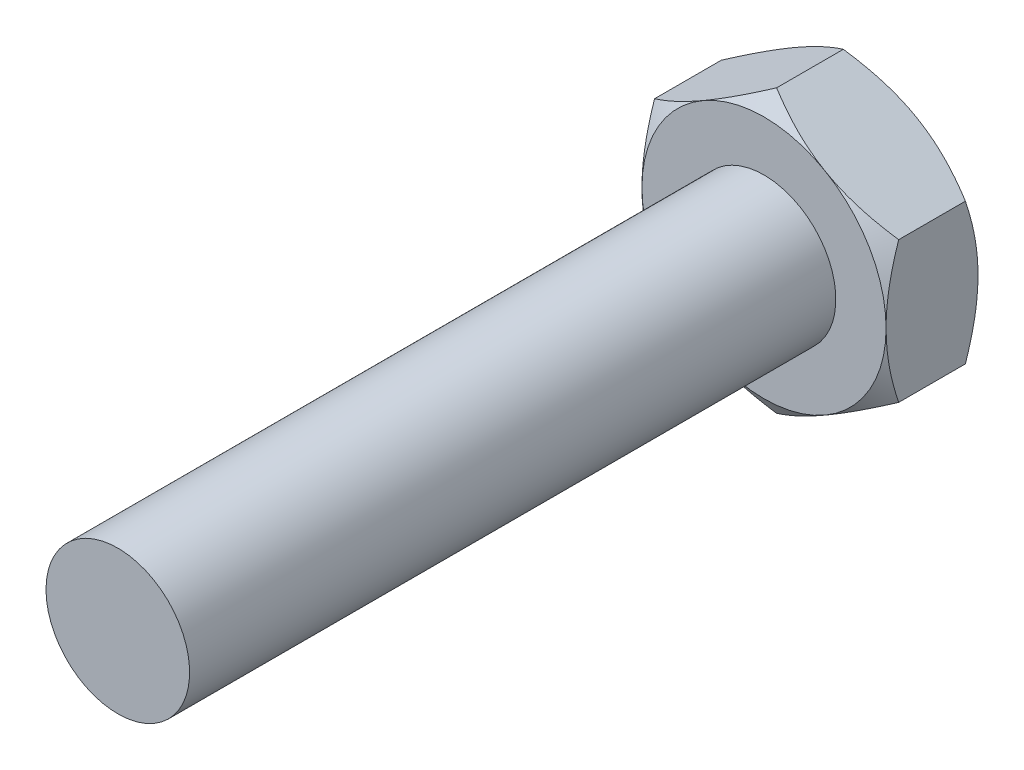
ISO-10303-21;
HEADER;
FILE_DESCRIPTION(('STEP AP214'),'2;1');
FILE_NAME('part.step','',(''),(''),'','','');
FILE_SCHEMA(('AUTOMOTIVE_DESIGN { 1 0 10303 214 1 1 1 1 }'));
ENDSEC;
DATA;
#1=APPLICATION_CONTEXT('core data for automotive mechanical design processes');
#2=APPLICATION_PROTOCOL_DEFINITION('international standard','automotive_design',2000,#1);
#3=PRODUCT_CONTEXT('',#1,'mechanical');
#4=PRODUCT('Part','Part','',(#3));
#5=PRODUCT_RELATED_PRODUCT_CATEGORY('part','',(#4));
#6=PRODUCT_DEFINITION_FORMATION('','',#4);
#7=PRODUCT_DEFINITION_CONTEXT('part definition',#1,'design');
#8=PRODUCT_DEFINITION('design','',#6,#7);
#9=PRODUCT_DEFINITION_SHAPE('','',#8);
#10=(LENGTH_UNIT() NAMED_UNIT(*) SI_UNIT(.MILLI.,.METRE.));
#11=(NAMED_UNIT(*) PLANE_ANGLE_UNIT() SI_UNIT($,.RADIAN.));
#12=(NAMED_UNIT(*) SI_UNIT($,.STERADIAN.) SOLID_ANGLE_UNIT());
#13=UNCERTAINTY_MEASURE_WITH_UNIT(LENGTH_MEASURE(1.E-05),#10,'distance_accuracy_value','');
#14=(GEOMETRIC_REPRESENTATION_CONTEXT(3) GLOBAL_UNCERTAINTY_ASSIGNED_CONTEXT((#13)) GLOBAL_UNIT_ASSIGNED_CONTEXT((#10,
#11,#12)) REPRESENTATION_CONTEXT('',''));
#15=CARTESIAN_POINT('',(0.,0.,0.));
#16=DIRECTION('',(0.,0.,1.));
#17=DIRECTION('',(1.,0.,0.));
#18=AXIS2_PLACEMENT_3D('',#15,#16,#17);
#19=CARTESIAN_POINT('',(8.5,-4.90747728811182,6.4));
#20=DIRECTION('',(-1.,0.,0.));
#21=DIRECTION('',(0.,-1.,0.));
#22=AXIS2_PLACEMENT_3D('',#19,#20,#21);
#23=PLANE('',#22);
#24=DIRECTION('',(0.,0.,-1.));
#25=VECTOR('',#24,1.);
#26=CARTESIAN_POINT('',(8.5,4.90747728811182,6.4));
#27=LINE('',#26,#25);
#28=CARTESIAN_POINT('',(8.5,4.90747728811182,5.52336361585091));
#29=VERTEX_POINT('',#28);
#30=CARTESIAN_POINT('',(8.5,4.90747728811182,0.876636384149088));
#31=VERTEX_POINT('',#30);
#32=EDGE_CURVE('E151',#29,#31,#27,.T.);
#33=ORIENTED_EDGE('',*,*,#32,.F.);
#34=CARTESIAN_POINT('',(8.5,-12.6656336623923,1.89768821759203));
#35=CARTESIAN_POINT('',(8.5,-12.319403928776,2.08929758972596));
#36=CARTESIAN_POINT('',(8.5,-11.9721686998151,2.2791205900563));
#37=CARTESIAN_POINT('',(8.5,-11.2751753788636,2.6542242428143));
#38=CARTESIAN_POINT('',(8.5,-10.9254168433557,2.83950407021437));
#39=CARTESIAN_POINT('',(8.5,-10.2208088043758,3.20561506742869));
#40=CARTESIAN_POINT('',(8.5,-9.86594117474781,3.38641147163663));
#41=CARTESIAN_POINT('',(8.5,-9.15270039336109,3.74092648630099));
#42=CARTESIAN_POINT('',(8.5,-8.79432743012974,3.91464547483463));
#43=CARTESIAN_POINT('',(8.5,-8.05883660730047,4.26000470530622));
#44=CARTESIAN_POINT('',(8.5,-7.68154571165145,4.43127847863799));
#45=CARTESIAN_POINT('',(8.5,-6.92149272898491,4.76145049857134));
#46=CARTESIAN_POINT('',(8.5,-6.53872993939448,4.92034713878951));
#47=CARTESIAN_POINT('',(8.5,-5.76773338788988,5.22173433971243));
#48=CARTESIAN_POINT('',(8.5,-5.3795140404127,5.36426137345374));
#49=CARTESIAN_POINT('',(8.5,-4.59615946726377,5.62856525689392));
#50=CARTESIAN_POINT('',(8.5,-4.2010267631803,5.75034950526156));
#51=CARTESIAN_POINT('',(8.5,-3.38121064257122,5.97349001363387));
#52=CARTESIAN_POINT('',(8.5,-2.95610376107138,6.07333860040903));
#53=CARTESIAN_POINT('',(8.5,-2.31325326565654,6.19549883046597));
#54=CARTESIAN_POINT('',(8.5,-2.09809788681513,6.23161750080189));
#55=CARTESIAN_POINT('',(8.5,-1.66635562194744,6.2938428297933));
#56=CARTESIAN_POINT('',(8.5,-1.44976894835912,6.31995094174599));
#57=CARTESIAN_POINT('',(8.5,-1.01914984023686,6.36115218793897));
#58=CARTESIAN_POINT('',(8.5,-0.805134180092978,6.37641985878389));
#59=CARTESIAN_POINT('',(8.5,-0.376605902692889,6.39623059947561));
#60=CARTESIAN_POINT('',(8.5,-0.162093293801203,6.40077384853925));
#61=CARTESIAN_POINT('',(8.5,0.26690788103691,6.3990107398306));
#62=CARTESIAN_POINT('',(8.5,0.481396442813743,6.39270335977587));
#63=CARTESIAN_POINT('',(8.5,0.909791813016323,6.36941085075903));
#64=CARTESIAN_POINT('',(8.5,1.12369860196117,6.35242536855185));
#65=CARTESIAN_POINT('',(8.5,1.58753059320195,6.30437286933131));
#66=CARTESIAN_POINT('',(8.5,1.83725645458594,6.27137198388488));
#67=CARTESIAN_POINT('',(8.5,2.33461795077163,6.19235151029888));
#68=CARTESIAN_POINT('',(8.5,2.5822534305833,6.14633096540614));
#69=CARTESIAN_POINT('',(8.5,3.32164787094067,5.99068136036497));
#70=CARTESIAN_POINT('',(8.5,3.80976459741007,5.86347907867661));
#71=CARTESIAN_POINT('',(8.5,4.53943756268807,5.64421539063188));
#72=CARTESIAN_POINT('',(8.5,4.78514623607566,5.56526942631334));
#73=CARTESIAN_POINT('',(8.5,5.27386228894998,5.39935263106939));
#74=CARTESIAN_POINT('',(8.5,5.51686965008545,5.31238174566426));
#75=CARTESIAN_POINT('',(8.5,6.00025315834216,5.13163510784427));
#76=CARTESIAN_POINT('',(8.5,6.24062992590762,5.03786100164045));
#77=CARTESIAN_POINT('',(8.5,6.71902382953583,4.84450549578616));
#78=CARTESIAN_POINT('',(8.5,6.95704100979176,4.74492420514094));
#79=CARTESIAN_POINT('',(8.5,7.57277253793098,4.47974433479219));
#80=CARTESIAN_POINT('',(8.5,7.94883245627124,4.3103064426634));
#81=CARTESIAN_POINT('',(8.5,8.69639823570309,3.96163134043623));
#82=CARTESIAN_POINT('',(8.5,9.06790358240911,3.78239303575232));
#83=CARTESIAN_POINT('',(8.5,9.80724128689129,3.41614910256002));
#84=CARTESIAN_POINT('',(8.5,10.1750720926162,3.22914035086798));
#85=CARTESIAN_POINT('',(8.5,10.907535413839,2.849014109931));
#86=CARTESIAN_POINT('',(8.5,11.2721680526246,2.65589685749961));
#87=CARTESIAN_POINT('',(8.5,11.9994706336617,2.26437185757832));
#88=CARTESIAN_POINT('',(8.5,12.3621355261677,2.06595474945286));
#89=CARTESIAN_POINT('',(8.5,13.0852384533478,1.6651037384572));
#90=CARTESIAN_POINT('',(8.5,13.4456764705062,1.46266980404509));
#91=CARTESIAN_POINT('',(8.5,14.1645936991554,1.05454794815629));
#92=CARTESIAN_POINT('',(8.5,14.5230733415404,0.848860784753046));
#93=CARTESIAN_POINT('',(8.5,15.2384446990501,0.434741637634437));
#94=CARTESIAN_POINT('',(8.5,15.5953364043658,0.226309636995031));
#95=CARTESIAN_POINT('',(8.5,16.5902267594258,-0.359025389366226));
#96=CARTESIAN_POINT('',(8.5,17.2267327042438,-0.738465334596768));
#97=CARTESIAN_POINT('',(8.5,18.4964831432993,-1.5028368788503));
#98=CARTESIAN_POINT('',(8.49999999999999,19.12972743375,-1.88776881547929));
#99=CARTESIAN_POINT('',(8.49999999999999,20.3910331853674,-2.66021595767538));
#100=CARTESIAN_POINT('',(8.49999999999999,21.0191052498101,-3.04771386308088));
#101=CARTESIAN_POINT('',(8.49999999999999,21.959673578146,-3.63137569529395));
#102=CARTESIAN_POINT('',(8.49999999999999,22.272925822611,-3.82632340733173));
#103=CARTESIAN_POINT('',(8.49999999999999,22.898976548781,-4.21694458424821));
#104=CARTESIAN_POINT('',(8.49999999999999,23.2117750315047,-4.41261804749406));
#105=CARTESIAN_POINT('',(8.49999999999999,23.5243723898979,-4.60861239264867));
#106=B_SPLINE_CURVE_WITH_KNOTS('',3,(#34,#35,#36,#37,#38,#39,#40,#41,#42,#43,#44,#45,#46,#47,
#48,#49,#50,#51,#52,#53,#54,#55,#56,#57,#58,#59,#60,#61,#62,#63,#64,#65,#66,#67,#68,#69,#70,#71,
#72,#73,#74,#75,#76,#77,#78,#79,#80,#81,#82,#83,#84,#85,#86,#87,#88,#89,#90,#91,#92,#93,#94,#95,
#96,#97,#98,#99,#100,#101,#102,#103,#104,#105),.UNSPECIFIED.,.F.,.F.,(4,2,2,2,2,2,2,2,2,2,2,2,2,
2,2,2,2,2,2,2,2,2,2,2,2,2,2,2,2,2,2,2,2,2,2,4),(0.,1.18715725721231,2.37452852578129,
3.56927236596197,4.76395229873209,6.0068194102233,7.2498475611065,8.49005007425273,
9.72980929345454,11.0383310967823,11.6926331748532,12.3468402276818,12.9902594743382,
13.6336679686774,14.2771370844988,14.9206274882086,15.675922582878,16.431273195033,
17.9423659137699,18.7165255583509,19.4906904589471,20.2646686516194,21.0386323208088,
22.2758393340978,23.5131848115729,24.7510325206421,25.988832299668,27.22898548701,
28.4691484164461,29.7090264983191,30.9489122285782,33.171938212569,35.3951014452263,
37.6090577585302,38.7159374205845,39.8228145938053),.UNSPECIFIED.);
#107=CARTESIAN_POINT('',(8.50000000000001,0.,6.4));
#108=VERTEX_POINT('',#107);
#109=EDGE_CURVE('E133',#29,#108,#106,.F.);
#110=ORIENTED_EDGE('',*,*,#109,.T.);
#111=CARTESIAN_POINT('',(8.5,-4.90747728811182,5.52336361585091));
#112=VERTEX_POINT('',#111);
#113=EDGE_CURVE('E123',#108,#112,#106,.F.);
#114=ORIENTED_EDGE('',*,*,#113,.T.);
#115=DIRECTION('',(0.,0.,-1.));
#116=VECTOR('',#115,1.);
#117=CARTESIAN_POINT('',(8.5,-4.90747728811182,6.4));
#118=LINE('',#117,#116);
#119=CARTESIAN_POINT('',(8.5,-4.90747728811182,0.876636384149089));
#120=VERTEX_POINT('',#119);
#121=EDGE_CURVE('E241',#112,#120,#118,.T.);
#122=ORIENTED_EDGE('',*,*,#121,.T.);
#123=CARTESIAN_POINT('',(8.5,-12.6656336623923,4.50231178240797));
#124=CARTESIAN_POINT('',(8.5,-12.319403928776,4.31070241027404));
#125=CARTESIAN_POINT('',(8.5,-11.9721686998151,4.12087940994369));
#126=CARTESIAN_POINT('',(8.5,-11.2751753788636,3.7457757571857));
#127=CARTESIAN_POINT('',(8.5,-10.9254168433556,3.56049592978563));
#128=CARTESIAN_POINT('',(8.5,-10.2208088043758,3.19438493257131));
#129=CARTESIAN_POINT('',(8.5,-9.86594117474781,3.01358852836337));
#130=CARTESIAN_POINT('',(8.5,-9.15270039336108,2.65907351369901));
#131=CARTESIAN_POINT('',(8.5,-8.79432743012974,2.48535452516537));
#132=CARTESIAN_POINT('',(8.5,-8.05883660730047,2.13999529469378));
#133=CARTESIAN_POINT('',(8.5,-7.68154571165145,1.96872152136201));
#134=CARTESIAN_POINT('',(8.5,-6.92149272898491,1.63854950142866));
#135=CARTESIAN_POINT('',(8.5,-6.53872993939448,1.47965286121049));
#136=CARTESIAN_POINT('',(8.5,-5.76773338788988,1.17826566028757));
#137=CARTESIAN_POINT('',(8.5,-5.3795140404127,1.03573862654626));
#138=CARTESIAN_POINT('',(8.5,-4.59615946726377,0.771434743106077));
#139=CARTESIAN_POINT('',(8.5,-4.2010267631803,0.649650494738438));
#140=CARTESIAN_POINT('',(8.5,-3.38121064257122,0.426509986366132));
#141=CARTESIAN_POINT('',(8.5,-2.95610376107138,0.32666139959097));
#142=CARTESIAN_POINT('',(8.5,-2.31325326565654,0.204501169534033));
#143=CARTESIAN_POINT('',(8.5,-2.09809788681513,0.168382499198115));
#144=CARTESIAN_POINT('',(8.5,-1.66635562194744,0.106157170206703));
#145=CARTESIAN_POINT('',(8.5,-1.44976894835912,0.0800490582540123));
#146=CARTESIAN_POINT('',(8.5,-1.01914984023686,0.0388478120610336));
#147=CARTESIAN_POINT('',(8.5,-0.805134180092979,0.0235801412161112));
#148=CARTESIAN_POINT('',(8.5,-0.376605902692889,0.00376940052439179));
#149=CARTESIAN_POINT('',(8.5,-0.162093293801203,-0.00077384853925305));
#150=CARTESIAN_POINT('',(8.5,0.26690788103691,0.000989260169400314));
#151=CARTESIAN_POINT('',(8.5,0.481396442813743,0.00729664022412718));
#152=CARTESIAN_POINT('',(8.5,0.909791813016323,0.0305891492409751));
#153=CARTESIAN_POINT('',(8.5,1.12369860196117,0.0475746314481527));
#154=CARTESIAN_POINT('',(8.5,1.58753059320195,0.095627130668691));
#155=CARTESIAN_POINT('',(8.5,1.83725645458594,0.128628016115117));
#156=CARTESIAN_POINT('',(8.5,2.33461795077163,0.207648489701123));
#157=CARTESIAN_POINT('',(8.5,2.5822534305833,0.253669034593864));
#158=CARTESIAN_POINT('',(8.5,3.32164787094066,0.409318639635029));
#159=CARTESIAN_POINT('',(8.5,3.80976459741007,0.536520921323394));
#160=CARTESIAN_POINT('',(8.5,4.53943756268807,0.755784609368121));
#161=CARTESIAN_POINT('',(8.5,4.78514623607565,0.834730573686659));
#162=CARTESIAN_POINT('',(8.5,5.27386228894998,1.00064736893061));
#163=CARTESIAN_POINT('',(8.5,5.51686965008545,1.08761825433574));
#164=CARTESIAN_POINT('',(8.5,6.00025315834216,1.26836489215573));
#165=CARTESIAN_POINT('',(8.5,6.24062992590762,1.36213899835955));
#166=CARTESIAN_POINT('',(8.5,6.71902382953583,1.55549450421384));
#167=CARTESIAN_POINT('',(8.5,6.95704100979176,1.65507579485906));
#168=CARTESIAN_POINT('',(8.5,7.57277253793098,1.92025566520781));
#169=CARTESIAN_POINT('',(8.5,7.94883245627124,2.0896935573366));
#170=CARTESIAN_POINT('',(8.5,8.69639823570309,2.43836865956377));
#171=CARTESIAN_POINT('',(8.5,9.06790358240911,2.61760696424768));
#172=CARTESIAN_POINT('',(8.5,9.80724128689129,2.98385089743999));
#173=CARTESIAN_POINT('',(8.5,10.1750720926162,3.17085964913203));
#174=CARTESIAN_POINT('',(8.5,10.907535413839,3.55098589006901));
#175=CARTESIAN_POINT('',(8.5,11.2721680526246,3.74410314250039));
#176=CARTESIAN_POINT('',(8.5,11.9994706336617,4.13562814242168));
#177=CARTESIAN_POINT('',(8.5,12.3621355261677,4.33404525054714));
#178=CARTESIAN_POINT('',(8.5,13.0852384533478,4.7348962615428));
#179=CARTESIAN_POINT('',(8.5,13.4456764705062,4.93733019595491));
#180=CARTESIAN_POINT('',(8.5,14.1645936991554,5.34545205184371));
#181=CARTESIAN_POINT('',(8.5,14.5230733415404,5.55113921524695));
#182=CARTESIAN_POINT('',(8.5,15.2384446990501,5.96525836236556));
#183=CARTESIAN_POINT('',(8.5,15.5953364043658,6.17369036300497));
#184=CARTESIAN_POINT('',(8.5,16.5902267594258,6.75902538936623));
#185=CARTESIAN_POINT('',(8.5,17.2267327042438,7.13846533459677));
#186=CARTESIAN_POINT('',(8.5,18.4964831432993,7.90283687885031));
#187=CARTESIAN_POINT('',(8.49999999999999,19.12972743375,8.2877688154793));
#188=CARTESIAN_POINT('',(8.49999999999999,20.3910331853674,9.06021595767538));
#189=CARTESIAN_POINT('',(8.49999999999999,21.0191052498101,9.44771386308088));
#190=CARTESIAN_POINT('',(8.49999999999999,21.959673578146,10.0313756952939));
#191=CARTESIAN_POINT('',(8.49999999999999,22.272925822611,10.2263234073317));
#192=CARTESIAN_POINT('',(8.49999999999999,22.898976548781,10.6169445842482));
#193=CARTESIAN_POINT('',(8.49999999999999,23.2117750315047,10.8126180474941));
#194=CARTESIAN_POINT('',(8.49999999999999,23.5243723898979,11.0086123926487));
#195=B_SPLINE_CURVE_WITH_KNOTS('',3,(#123,#124,#125,#126,#127,#128,#129,#130,#131,#132,#133,
#134,#135,#136,#137,#138,#139,#140,#141,#142,#143,#144,#145,#146,#147,#148,#149,#150,#151,#152,
#153,#154,#155,#156,#157,#158,#159,#160,#161,#162,#163,#164,#165,#166,#167,#168,#169,#170,#171,
#172,#173,#174,#175,#176,#177,#178,#179,#180,#181,#182,#183,#184,#185,#186,#187,#188,#189,#190,
#191,#192,#193,#194),.UNSPECIFIED.,.F.,.F.,(4,2,2,2,2,2,2,2,2,2,2,2,2,2,2,2,2,2,2,2,2,2,2,2,2,2,
2,2,2,2,2,2,2,2,2,4),(0.,1.18715725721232,2.37452852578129,3.56927236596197,4.76395229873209,
6.0068194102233,7.2498475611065,8.49005007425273,9.72980929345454,11.0383310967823,
11.6926331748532,12.3468402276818,12.9902594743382,13.6336679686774,14.2771370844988,
14.9206274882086,15.675922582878,16.431273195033,17.9423659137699,18.7165255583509,
19.4906904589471,20.2646686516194,21.0386323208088,22.2758393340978,23.5131848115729,
24.7510325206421,25.988832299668,27.22898548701,28.4691484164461,29.7090264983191,
30.9489122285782,33.171938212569,35.3951014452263,37.6090577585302,38.7159374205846,
39.8228145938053),.UNSPECIFIED.);
#196=CARTESIAN_POINT('',(8.50000000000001,0.,0.));
#197=VERTEX_POINT('',#196);
#198=EDGE_CURVE('E237',#120,#197,#195,.T.);
#199=ORIENTED_EDGE('',*,*,#198,.T.);
#200=EDGE_CURVE('E231',#197,#31,#195,.T.);
#201=ORIENTED_EDGE('',*,*,#200,.T.);
#202=EDGE_LOOP('',(#33,#110,#114,#122,#199,#201));
#203=FACE_BOUND('',#202,.T.);
#204=ADVANCED_FACE('F34',(#203),#23,.F.);
#205=CARTESIAN_POINT('',(8.5,4.90747728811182,6.4));
#206=DIRECTION('',(-0.5,-0.866025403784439,0.));
#207=DIRECTION('',(0.866025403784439,-0.5,0.));
#208=AXIS2_PLACEMENT_3D('',#205,#206,#207);
#209=PLANE('',#208);
#210=DIRECTION('',(0.,0.,-1.));
#211=VECTOR('',#210,1.);
#212=CARTESIAN_POINT('',(0.,9.81495457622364,6.4));
#213=LINE('',#212,#211);
#214=CARTESIAN_POINT('',(0.,9.81495457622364,5.52336361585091));
#215=VERTEX_POINT('',#214);
#216=CARTESIAN_POINT('',(0.,9.81495457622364,0.87663638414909));
#217=VERTEX_POINT('',#216);
#218=EDGE_CURVE('E252',#215,#217,#213,.T.);
#219=ORIENTED_EDGE('',*,*,#218,.F.);
#220=CARTESIAN_POINT('',(-0.000199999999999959,9.81507004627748,5.52328663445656));
#221=CARTESIAN_POINT('',(0.189266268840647,9.70568164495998,5.59620573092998));
#222=CARTESIAN_POINT('',(0.379707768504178,9.59573019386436,5.66586141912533));
#223=CARTESIAN_POINT('',(0.762657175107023,9.3746342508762,5.79765257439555));
#224=CARTESIAN_POINT('',(0.955166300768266,9.26348905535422,5.85978330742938));
#225=CARTESIAN_POINT('',(1.34277705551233,9.03970188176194,5.97563074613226));
#226=CARTESIAN_POINT('',(1.53788520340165,8.92705614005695,6.0293186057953));
#227=CARTESIAN_POINT('',(1.92987966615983,8.70073803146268,6.12691582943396));
#228=CARTESIAN_POINT('',(2.12676544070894,8.58706597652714,6.17082806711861));
#229=CARTESIAN_POINT('',(2.51562515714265,8.36255771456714,6.24658105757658));
#230=CARTESIAN_POINT('',(2.70754769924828,8.25175118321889,6.27877130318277));
#231=CARTESIAN_POINT('',(3.09254534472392,8.02947268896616,6.3322295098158));
#232=CARTESIAN_POINT('',(3.28562047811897,7.91800070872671,6.35349718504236));
#233=CARTESIAN_POINT('',(3.67213439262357,7.69484679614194,6.38448895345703));
#234=CARTESIAN_POINT('',(3.86557196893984,7.58316555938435,6.39423292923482));
#235=CARTESIAN_POINT('',(4.25261780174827,7.35970454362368,6.40195649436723));
#236=CARTESIAN_POINT('',(4.44622604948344,7.24792476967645,6.39993665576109));
#237=CARTESIAN_POINT('',(4.80163522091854,7.04272918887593,6.38547624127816));
#238=CARTESIAN_POINT('',(4.96349127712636,6.94928155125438,6.3747827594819));
#239=CARTESIAN_POINT('',(5.28666480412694,6.76269722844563,6.3454185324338));
#240=CARTESIAN_POINT('',(5.44798222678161,6.66956057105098,6.32674709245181));
#241=CARTESIAN_POINT('',(5.93109093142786,6.39063763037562,6.25921858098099));
#242=CARTESIAN_POINT('',(6.25171604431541,6.20552463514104,6.19886160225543));
#243=CARTESIAN_POINT('',(6.8973701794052,5.83275604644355,6.04949438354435));
#244=CARTESIAN_POINT('',(7.22225989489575,5.64518088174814,5.95970863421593));
#245=CARTESIAN_POINT('',(7.86577713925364,5.27364602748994,5.75733359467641));
#246=CARTESIAN_POINT('',(8.18441910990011,5.08967799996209,5.64480602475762));
#247=CARTESIAN_POINT('',(8.5002,4.90736181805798,5.52328663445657));
#248=B_SPLINE_CURVE_WITH_KNOTS('',3,(#220,#221,#222,#223,#224,#225,#226,#227,#228,#229,#230,
#231,#232,#233,#234,#235,#236,#237,#238,#239,#240,#241,#242,#243,#244,#245,#246,#247),
.UNSPECIFIED.,.F.,.F.,(4,2,2,2,2,2,2,2,2,2,2,2,2,4),(0.,0.691855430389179,1.3841438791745,
2.07874849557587,2.77314865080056,3.44471271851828,4.11629435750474,4.78671557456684,
5.45710419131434,6.0185311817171,6.58000707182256,7.70407365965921,8.86052934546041,
10.0138876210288),.UNSPECIFIED.);
#249=CARTESIAN_POINT('',(4.25000000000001,7.36121593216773,6.4));
#250=VERTEX_POINT('',#249);
#251=EDGE_CURVE('E199',#215,#250,#248,.T.);
#252=ORIENTED_EDGE('',*,*,#251,.T.);
#253=EDGE_CURVE('E141',#250,#29,#248,.T.);
#254=ORIENTED_EDGE('',*,*,#253,.T.);
#255=ORIENTED_EDGE('',*,*,#32,.T.);
#256=CARTESIAN_POINT('',(8.5002,4.90736181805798,0.876713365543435));
#257=CARTESIAN_POINT('',(8.31073373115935,5.01675021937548,0.803794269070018));
#258=CARTESIAN_POINT('',(8.12029223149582,5.1267016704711,0.734138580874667));
#259=CARTESIAN_POINT('',(7.73734282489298,5.34779761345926,0.60234742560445));
#260=CARTESIAN_POINT('',(7.54483369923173,5.45894280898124,0.540216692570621));
#261=CARTESIAN_POINT('',(7.15722294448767,5.68272998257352,0.424369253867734));
#262=CARTESIAN_POINT('',(6.96211479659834,5.79537572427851,0.370681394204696));
#263=CARTESIAN_POINT('',(6.57012033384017,6.02169383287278,0.273084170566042));
#264=CARTESIAN_POINT('',(6.37323455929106,6.13536588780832,0.22917193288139));
#265=CARTESIAN_POINT('',(5.98437484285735,6.35987414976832,0.153418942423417));
#266=CARTESIAN_POINT('',(5.79245230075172,6.47068068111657,0.121228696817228));
#267=CARTESIAN_POINT('',(5.40745465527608,6.6929591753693,0.0677704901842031));
#268=CARTESIAN_POINT('',(5.21437952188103,6.80443115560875,0.046502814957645));
#269=CARTESIAN_POINT('',(4.82786560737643,7.02758506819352,0.0155110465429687));
#270=CARTESIAN_POINT('',(4.63442803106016,7.13926630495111,0.00576707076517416));
#271=CARTESIAN_POINT('',(4.24738219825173,7.36272732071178,-0.00195649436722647));
#272=CARTESIAN_POINT('',(4.05377395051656,7.47450709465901,6.33442389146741E-05));
#273=CARTESIAN_POINT('',(3.69836477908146,7.67970267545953,0.0145237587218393));
#274=CARTESIAN_POINT('',(3.53650872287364,7.77315031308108,0.0252172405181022));
#275=CARTESIAN_POINT('',(3.21333519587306,7.95973463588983,0.0545814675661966));
#276=CARTESIAN_POINT('',(3.0520177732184,8.05287129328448,0.0732529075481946));
#277=CARTESIAN_POINT('',(2.56890906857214,8.33179423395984,0.140781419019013));
#278=CARTESIAN_POINT('',(2.2482839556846,8.51690722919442,0.201138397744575));
#279=CARTESIAN_POINT('',(1.60262982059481,8.88967581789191,0.350505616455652));
#280=CARTESIAN_POINT('',(1.27774010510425,9.07725098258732,0.440291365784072));
#281=CARTESIAN_POINT('',(0.63422286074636,9.44878583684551,0.642666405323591));
#282=CARTESIAN_POINT('',(0.315580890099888,9.63275386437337,0.755193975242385));
#283=CARTESIAN_POINT('',(-0.000199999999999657,9.81507004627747,0.876713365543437));
#284=B_SPLINE_CURVE_WITH_KNOTS('',3,(#256,#257,#258,#259,#260,#261,#262,#263,#264,#265,#266,
#267,#268,#269,#270,#271,#272,#273,#274,#275,#276,#277,#278,#279,#280,#281,#282,#283),
.UNSPECIFIED.,.F.,.F.,(4,2,2,2,2,2,2,2,2,2,2,2,2,4),(0.,0.691855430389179,1.3841438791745,
2.07874849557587,2.77314865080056,3.44471271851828,4.11629435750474,4.78671557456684,
5.45710419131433,6.0185311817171,6.58000707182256,7.70407365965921,8.86052934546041,
10.0138876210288),.UNSPECIFIED.);
#285=CARTESIAN_POINT('',(4.25000000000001,7.36121593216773,0.));
#286=VERTEX_POINT('',#285);
#287=EDGE_CURVE('E223',#31,#286,#284,.T.);
#288=ORIENTED_EDGE('',*,*,#287,.T.);
#289=EDGE_CURVE('E215',#286,#217,#284,.T.);
#290=ORIENTED_EDGE('',*,*,#289,.T.);
#291=EDGE_LOOP('',(#219,#252,#254,#255,#288,#290));
#292=FACE_BOUND('',#291,.T.);
#293=ADVANCED_FACE('F207',(#292),#209,.F.);
#294=CARTESIAN_POINT('',(0.,9.81495457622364,6.4));
#295=DIRECTION('',(0.5,-0.866025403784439,0.));
#296=DIRECTION('',(0.866025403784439,0.5,0.));
#297=AXIS2_PLACEMENT_3D('',#294,#295,#296);
#298=PLANE('',#297);
#299=DIRECTION('',(0.,0.,-1.));
#300=VECTOR('',#299,1.);
#301=CARTESIAN_POINT('',(-8.5,4.90747728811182,6.4));
#302=LINE('',#301,#300);
#303=CARTESIAN_POINT('',(-8.5,4.90747728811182,5.52336361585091));
#304=VERTEX_POINT('',#303);
#305=CARTESIAN_POINT('',(-8.5,4.90747728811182,0.876636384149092));
#306=VERTEX_POINT('',#305);
#307=EDGE_CURVE('E250',#304,#306,#302,.T.);
#308=ORIENTED_EDGE('',*,*,#307,.F.);
#309=CARTESIAN_POINT('',(-8.5002,4.90736181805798,5.52328663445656));
#310=CARTESIAN_POINT('',(-8.31073373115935,5.01675021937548,5.59620573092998));
#311=CARTESIAN_POINT('',(-8.12029223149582,5.1267016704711,5.66586141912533));
#312=CARTESIAN_POINT('',(-7.73734282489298,5.34779761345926,5.79765257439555));
#313=CARTESIAN_POINT('',(-7.54483369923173,5.45894280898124,5.85978330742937));
#314=CARTESIAN_POINT('',(-7.15722294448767,5.68272998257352,5.97563074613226));
#315=CARTESIAN_POINT('',(-6.96211479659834,5.79537572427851,6.0293186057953));
#316=CARTESIAN_POINT('',(-6.57012033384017,6.02169383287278,6.12691582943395));
#317=CARTESIAN_POINT('',(-6.37323455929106,6.13536588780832,6.17082806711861));
#318=CARTESIAN_POINT('',(-5.98437484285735,6.35987414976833,6.24658105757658));
#319=CARTESIAN_POINT('',(-5.79245230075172,6.47068068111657,6.27877130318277));
#320=CARTESIAN_POINT('',(-5.40745465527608,6.6929591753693,6.33222950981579));
#321=CARTESIAN_POINT('',(-5.21437952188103,6.80443115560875,6.35349718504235));
#322=CARTESIAN_POINT('',(-4.82786560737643,7.02758506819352,6.38448895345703));
#323=CARTESIAN_POINT('',(-4.63442803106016,7.13926630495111,6.39423292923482));
#324=CARTESIAN_POINT('',(-4.24738219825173,7.36272732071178,6.40195649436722));
#325=CARTESIAN_POINT('',(-4.05377395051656,7.47450709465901,6.39993665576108));
#326=CARTESIAN_POINT('',(-3.69836477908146,7.67970267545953,6.38547624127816));
#327=CARTESIAN_POINT('',(-3.53650872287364,7.77315031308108,6.37478275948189));
#328=CARTESIAN_POINT('',(-3.21333519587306,7.95973463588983,6.3454185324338));
#329=CARTESIAN_POINT('',(-3.05201777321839,8.05287129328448,6.3267470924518));
#330=CARTESIAN_POINT('',(-2.56890906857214,8.33179423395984,6.25921858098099));
#331=CARTESIAN_POINT('',(-2.24828395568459,8.51690722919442,6.19886160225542));
#332=CARTESIAN_POINT('',(-1.6026298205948,8.88967581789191,6.04949438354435));
#333=CARTESIAN_POINT('',(-1.27774010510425,9.07725098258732,5.95970863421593));
#334=CARTESIAN_POINT('',(-0.634222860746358,9.44878583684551,5.75733359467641));
#335=CARTESIAN_POINT('',(-0.315580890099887,9.63275386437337,5.64480602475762));
#336=CARTESIAN_POINT('',(0.000199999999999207,9.81507004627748,5.52328663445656));
#337=B_SPLINE_CURVE_WITH_KNOTS('',3,(#309,#310,#311,#312,#313,#314,#315,#316,#317,#318,#319,
#320,#321,#322,#323,#324,#325,#326,#327,#328,#329,#330,#331,#332,#333,#334,#335,#336),
.UNSPECIFIED.,.F.,.F.,(4,2,2,2,2,2,2,2,2,2,2,2,2,4),(0.,0.691855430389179,1.3841438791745,
2.07874849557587,2.77314865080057,3.44471271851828,4.11629435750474,4.78671557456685,
5.45710419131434,6.01853118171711,6.58000707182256,7.70407365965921,8.86052934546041,
10.0138876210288),.UNSPECIFIED.);
#338=CARTESIAN_POINT('',(-4.25,7.36121593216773,6.4));
#339=VERTEX_POINT('',#338);
#340=EDGE_CURVE('E324',#304,#339,#337,.T.);
#341=ORIENTED_EDGE('',*,*,#340,.T.);
#342=EDGE_CURVE('E200',#339,#215,#337,.T.);
#343=ORIENTED_EDGE('',*,*,#342,.T.);
#344=ORIENTED_EDGE('',*,*,#218,.T.);
#345=CARTESIAN_POINT('',(0.000200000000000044,9.81507004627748,0.876713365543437));
#346=CARTESIAN_POINT('',(-0.189266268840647,9.70568164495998,0.80379426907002));
#347=CARTESIAN_POINT('',(-0.379707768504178,9.59573019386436,0.73413858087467));
#348=CARTESIAN_POINT('',(-0.762657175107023,9.3746342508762,0.602347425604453));
#349=CARTESIAN_POINT('',(-0.955166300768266,9.26348905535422,0.540216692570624));
#350=CARTESIAN_POINT('',(-1.34277705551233,9.03970188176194,0.424369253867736));
#351=CARTESIAN_POINT('',(-1.53788520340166,8.92705614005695,0.370681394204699));
#352=CARTESIAN_POINT('',(-1.92987966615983,8.70073803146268,0.273084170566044));
#353=CARTESIAN_POINT('',(-2.12676544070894,8.58706597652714,0.229171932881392));
#354=CARTESIAN_POINT('',(-2.51562515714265,8.36255771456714,0.15341894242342));
#355=CARTESIAN_POINT('',(-2.70754769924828,8.25175118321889,0.12122869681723));
#356=CARTESIAN_POINT('',(-3.09254534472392,8.02947268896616,0.0677704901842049));
#357=CARTESIAN_POINT('',(-3.28562047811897,7.91800070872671,0.0465028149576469));
#358=CARTESIAN_POINT('',(-3.67213439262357,7.69484679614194,0.0155110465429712));
#359=CARTESIAN_POINT('',(-3.86557196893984,7.58316555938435,0.00576707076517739));
#360=CARTESIAN_POINT('',(-4.25261780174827,7.35970454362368,-0.00195649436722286));
#361=CARTESIAN_POINT('',(-4.44622604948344,7.24792476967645,6.33442389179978E-05));
#362=CARTESIAN_POINT('',(-4.80163522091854,7.04272918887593,0.0145237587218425));
#363=CARTESIAN_POINT('',(-4.96349127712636,6.94928155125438,0.0252172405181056));
#364=CARTESIAN_POINT('',(-5.28666480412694,6.76269722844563,0.0545814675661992));
#365=CARTESIAN_POINT('',(-5.44798222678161,6.66956057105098,0.0732529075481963));
#366=CARTESIAN_POINT('',(-5.93109093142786,6.39063763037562,0.140781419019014));
#367=CARTESIAN_POINT('',(-6.25171604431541,6.20552463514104,0.201138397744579));
#368=CARTESIAN_POINT('',(-6.8973701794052,5.83275604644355,0.350505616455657));
#369=CARTESIAN_POINT('',(-7.22225989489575,5.64518088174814,0.440291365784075));
#370=CARTESIAN_POINT('',(-7.86577713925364,5.27364602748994,0.642666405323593));
#371=CARTESIAN_POINT('',(-8.18441910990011,5.08967799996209,0.755193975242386));
#372=CARTESIAN_POINT('',(-8.5002,4.90736181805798,0.87671336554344));
#373=B_SPLINE_CURVE_WITH_KNOTS('',3,(#345,#346,#347,#348,#349,#350,#351,#352,#353,#354,#355,
#356,#357,#358,#359,#360,#361,#362,#363,#364,#365,#366,#367,#368,#369,#370,#371,#372),
.UNSPECIFIED.,.F.,.F.,(4,2,2,2,2,2,2,2,2,2,2,2,2,4),(0.,0.691855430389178,1.3841438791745,
2.07874849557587,2.77314865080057,3.44471271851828,4.11629435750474,4.78671557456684,
5.45710419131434,6.0185311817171,6.58000707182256,7.70407365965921,8.86052934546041,
10.0138876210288),.UNSPECIFIED.);
#374=CARTESIAN_POINT('',(-4.25,7.36121593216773,0.));
#375=VERTEX_POINT('',#374);
#376=EDGE_CURVE('E224',#217,#375,#373,.T.);
#377=ORIENTED_EDGE('',*,*,#376,.T.);
#378=EDGE_CURVE('E225',#375,#306,#373,.T.);
#379=ORIENTED_EDGE('',*,*,#378,.T.);
#380=EDGE_LOOP('',(#308,#341,#343,#344,#377,#379));
#381=FACE_BOUND('',#380,.T.);
#382=ADVANCED_FACE('F210',(#381),#298,.F.);
#383=CARTESIAN_POINT('',(-8.5,4.90747728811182,6.4));
#384=DIRECTION('',(1.,0.,0.));
#385=DIRECTION('',(0.,0.,-1.));
#386=AXIS2_PLACEMENT_3D('',#383,#384,#385);
#387=PLANE('',#386);
#388=DIRECTION('',(0.,0.,-1.));
#389=VECTOR('',#388,1.);
#390=CARTESIAN_POINT('',(-8.5,-4.90747728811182,6.4));
#391=LINE('',#390,#389);
#392=CARTESIAN_POINT('',(-8.5,-4.90747728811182,5.52336361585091));
#393=VERTEX_POINT('',#392);
#394=CARTESIAN_POINT('',(-8.5,-4.90747728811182,0.876636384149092));
#395=VERTEX_POINT('',#394);
#396=EDGE_CURVE('E248',#393,#395,#391,.T.);
#397=ORIENTED_EDGE('',*,*,#396,.F.);
#398=CARTESIAN_POINT('',(-8.5,-12.6656336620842,1.8976882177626));
#399=CARTESIAN_POINT('',(-8.5,-12.3194039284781,2.08929758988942));
#400=CARTESIAN_POINT('',(-8.5,-11.9721686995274,2.27912059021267));
#401=CARTESIAN_POINT('',(-8.5,-11.2751753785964,2.6542242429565));
#402=CARTESIAN_POINT('',(-8.5,-10.9254168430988,2.83950407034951));
#403=CARTESIAN_POINT('',(-8.5,-10.2208088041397,3.20561506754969));
#404=CARTESIAN_POINT('',(-8.5,-9.86594117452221,3.38641147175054));
#405=CARTESIAN_POINT('',(-8.5,-9.15270039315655,3.74092648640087));
#406=CARTESIAN_POINT('',(-8.5,-8.79432742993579,3.91464547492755));
#407=CARTESIAN_POINT('',(-8.5,-8.05883660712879,4.26000470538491));
#408=CARTESIAN_POINT('',(-8.5,-7.68154571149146,4.43127847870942));
#409=CARTESIAN_POINT('',(-8.5,-6.92149272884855,4.76145049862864));
#410=CARTESIAN_POINT('',(-8.5,-6.53872993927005,4.92034713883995));
#411=CARTESIAN_POINT('',(-8.5,-5.76773338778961,5.22173433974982));
#412=CARTESIAN_POINT('',(-8.5,-5.37951404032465,5.36426137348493));
#413=CARTESIAN_POINT('',(-8.5,-4.59615946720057,5.62856525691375));
#414=CARTESIAN_POINT('',(-8.5,-4.20102676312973,5.75034950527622));
#415=CARTESIAN_POINT('',(-8.5,-3.38121064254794,5.97349001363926));
#416=CARTESIAN_POINT('',(-8.5,-2.95610376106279,6.07333860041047));
#417=CARTESIAN_POINT('',(-8.5,-2.31325326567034,6.19549883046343));
#418=CARTESIAN_POINT('',(-8.5,-2.09809788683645,6.23161750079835));
#419=CARTESIAN_POINT('',(-8.5,-1.66635562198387,6.2938428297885));
#420=CARTESIAN_POINT('',(-8.5,-1.44976894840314,6.31995094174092));
#421=CARTESIAN_POINT('',(-8.5,-1.01914984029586,6.36115218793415));
#422=CARTESIAN_POINT('',(-8.5,-0.805134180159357,6.37641985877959));
#423=CARTESIAN_POINT('',(-8.5,-0.376605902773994,6.39623059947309));
#424=CARTESIAN_POINT('',(-8.5,-0.162093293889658,6.400773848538));
#425=CARTESIAN_POINT('',(-8.5,0.266907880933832,6.39901073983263));
#426=CARTESIAN_POINT('',(-8.5,0.481396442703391,6.39270335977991));
#427=CARTESIAN_POINT('',(-8.5,0.90979181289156,6.36941085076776));
#428=CARTESIAN_POINT('',(-8.5,1.12369860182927,6.35242536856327));
#429=CARTESIAN_POINT('',(-8.5,1.58753059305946,6.3043728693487));
#430=CARTESIAN_POINT('',(-8.5,1.83725645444,6.2713719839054));
#431=CARTESIAN_POINT('',(-8.5,2.33461795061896,6.1923515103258));
#432=CARTESIAN_POINT('',(-8.5,2.58225343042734,6.14633096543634));
#433=CARTESIAN_POINT('',(-8.5,3.32164787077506,5.99068136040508));
#434=CARTESIAN_POINT('',(-8.5,3.80976459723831,5.86347907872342));
#435=CARTESIAN_POINT('',(-8.5,4.53943756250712,5.6442153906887));
#436=CARTESIAN_POINT('',(-8.5,4.78514623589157,5.56526942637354));
#437=CARTESIAN_POINT('',(-8.5,5.27386228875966,5.39935263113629));
#438=CARTESIAN_POINT('',(-8.5,5.51686964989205,5.31238174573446));
#439=CARTESIAN_POINT('',(-8.5,6.00025315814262,5.13163510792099));
#440=CARTESIAN_POINT('',(-8.5,6.24062992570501,5.03786100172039));
#441=CARTESIAN_POINT('',(-8.5,6.71902382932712,4.84450549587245));
#442=CARTESIAN_POINT('',(-8.5,6.95704100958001,4.74492420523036));
#443=CARTESIAN_POINT('',(-8.5,7.57277253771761,4.47974433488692));
#444=CARTESIAN_POINT('',(-8.5,7.94883245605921,4.31030644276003));
#445=CARTESIAN_POINT('',(-8.5,8.69639823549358,3.9616313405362));
#446=CARTESIAN_POINT('',(-8.5,9.06790358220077,3.78239303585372));
#447=CARTESIAN_POINT('',(-8.5,9.80724128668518,3.41614910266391));
#448=CARTESIAN_POINT('',(-8.5,10.1750720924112,3.22914035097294));
#449=CARTESIAN_POINT('',(-8.5,10.9075354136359,2.84901411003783));
#450=CARTESIAN_POINT('',(-8.5,11.2721680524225,2.65589685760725));
#451=CARTESIAN_POINT('',(-8.5,11.9994706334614,2.26437185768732));
#452=CARTESIAN_POINT('',(-8.5,12.3621355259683,2.06595474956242));
#453=CARTESIAN_POINT('',(-8.5,13.0852384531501,1.66510373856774));
#454=CARTESIAN_POINT('',(-8.5,13.4456764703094,1.46266980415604));
#455=CARTESIAN_POINT('',(-8.5,14.1645936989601,1.05454794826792));
#456=CARTESIAN_POINT('',(-8.5,14.5230733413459,0.848860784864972));
#457=CARTESIAN_POINT('',(-8.5,15.2384446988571,0.434741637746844));
#458=CARTESIAN_POINT('',(-8.5,15.5953364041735,0.22630963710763));
#459=CARTESIAN_POINT('',(-8.5,16.5902267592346,-0.359025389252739));
#460=CARTESIAN_POINT('',(-8.5,17.226732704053,-0.738465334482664));
#461=CARTESIAN_POINT('',(-8.5,18.4964831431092,-1.50283687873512));
#462=CARTESIAN_POINT('',(-8.5,19.1297274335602,-1.88776881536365));
#463=CARTESIAN_POINT('',(-8.5,20.391033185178,-2.66021595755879));
#464=CARTESIAN_POINT('',(-8.5,21.0191052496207,-3.04771386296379));
#465=CARTESIAN_POINT('',(-8.5,21.9596735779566,-3.63137569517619));
#466=CARTESIAN_POINT('',(-8.5,22.2729258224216,-3.82632340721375));
#467=CARTESIAN_POINT('',(-8.5,22.8989765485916,-4.21694458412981));
#468=CARTESIAN_POINT('',(-8.5,23.2117750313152,-4.41261804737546));
#469=CARTESIAN_POINT('',(-8.5,23.5243723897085,-4.60861239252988));
#470=B_SPLINE_CURVE_WITH_KNOTS('',3,(#398,#399,#400,#401,#402,#403,#404,#405,#406,#407,#408,
#409,#410,#411,#412,#413,#414,#415,#416,#417,#418,#419,#420,#421,#422,#423,#424,#425,#426,#427,
#428,#429,#430,#431,#432,#433,#434,#435,#436,#437,#438,#439,#440,#441,#442,#443,#444,#445,#446,
#447,#448,#449,#450,#451,#452,#453,#454,#455,#456,#457,#458,#459,#460,#461,#462,#463,#464,#465,
#466,#467,#468,#469),.UNSPECIFIED.,.F.,.F.,(4,2,2,2,2,2,2,2,2,2,2,2,2,2,2,2,2,2,2,2,2,2,2,2,2,2,
2,2,2,2,2,2,2,2,2,4),(0.,1.18715725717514,2.37452852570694,3.56927236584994,4.76395229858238,
6.00681941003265,7.2498475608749,8.49005007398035,9.72980929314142,11.0383310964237,
11.6926331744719,12.3468402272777,12.9902594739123,13.6336679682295,14.277137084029,
14.9206274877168,15.6759225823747,16.4312731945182,17.9423659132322,18.7165255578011,
19.4906904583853,20.2646686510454,21.0386323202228,22.2758393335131,23.5131848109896,
24.75103252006,25.9888322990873,27.2289854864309,28.4691484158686,29.7090264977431,
30.9489122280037,33.1719382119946,35.3951014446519,37.6090577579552,38.7159374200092,
39.8228145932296),.UNSPECIFIED.);
#471=CARTESIAN_POINT('',(-8.5,0.,6.4));
#472=VERTEX_POINT('',#471);
#473=EDGE_CURVE('E152',#393,#472,#470,.T.);
#474=ORIENTED_EDGE('',*,*,#473,.T.);
#475=EDGE_CURVE('E328',#472,#304,#470,.T.);
#476=ORIENTED_EDGE('',*,*,#475,.T.);
#477=ORIENTED_EDGE('',*,*,#307,.T.);
#478=CARTESIAN_POINT('',(-8.5,-12.6656336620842,4.5023117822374));
#479=CARTESIAN_POINT('',(-8.5,-12.3194039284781,4.31070241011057));
#480=CARTESIAN_POINT('',(-8.5,-11.9721686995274,4.12087940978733));
#481=CARTESIAN_POINT('',(-8.5,-11.2751753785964,3.7457757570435));
#482=CARTESIAN_POINT('',(-8.5,-10.9254168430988,3.56049592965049));
#483=CARTESIAN_POINT('',(-8.5,-10.2208088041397,3.19438493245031));
#484=CARTESIAN_POINT('',(-8.5,-9.8659411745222,3.01358852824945));
#485=CARTESIAN_POINT('',(-8.5,-9.15270039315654,2.65907351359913));
#486=CARTESIAN_POINT('',(-8.5,-8.79432742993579,2.48535452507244));
#487=CARTESIAN_POINT('',(-8.5,-8.05883660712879,2.13999529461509));
#488=CARTESIAN_POINT('',(-8.5,-7.68154571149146,1.96872152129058));
#489=CARTESIAN_POINT('',(-8.5,-6.92149272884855,1.63854950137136));
#490=CARTESIAN_POINT('',(-8.5,-6.53872993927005,1.47965286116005));
#491=CARTESIAN_POINT('',(-8.5,-5.76773338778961,1.17826566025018));
#492=CARTESIAN_POINT('',(-8.5,-5.37951404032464,1.03573862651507));
#493=CARTESIAN_POINT('',(-8.5,-4.59615946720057,0.771434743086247));
#494=CARTESIAN_POINT('',(-8.5,-4.20102676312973,0.649650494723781));
#495=CARTESIAN_POINT('',(-8.5,-3.38121064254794,0.426509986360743));
#496=CARTESIAN_POINT('',(-8.5,-2.95610376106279,0.326661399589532));
#497=CARTESIAN_POINT('',(-8.5,-2.31325326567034,0.204501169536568));
#498=CARTESIAN_POINT('',(-8.5,-2.09809788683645,0.168382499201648));
#499=CARTESIAN_POINT('',(-8.5,-1.66635562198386,0.106157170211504));
#500=CARTESIAN_POINT('',(-8.5,-1.44976894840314,0.0800490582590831));
#501=CARTESIAN_POINT('',(-8.5,-1.01914984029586,0.0388478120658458));
#502=CARTESIAN_POINT('',(-8.5,-0.805134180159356,0.0235801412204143));
#503=CARTESIAN_POINT('',(-8.5,-0.376605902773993,0.00376940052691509));
#504=CARTESIAN_POINT('',(-8.5,-0.162093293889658,-0.000773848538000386));
#505=CARTESIAN_POINT('',(-8.5,0.266907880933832,0.000989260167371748));
#506=CARTESIAN_POINT('',(-8.5,0.481396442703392,0.00729664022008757));
#507=CARTESIAN_POINT('',(-8.5,0.90979181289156,0.0305891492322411));
#508=CARTESIAN_POINT('',(-8.5,1.12369860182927,0.0475746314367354));
#509=CARTESIAN_POINT('',(-8.5,1.58753059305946,0.0956271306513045));
#510=CARTESIAN_POINT('',(-8.5,1.83725645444,0.128628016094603));
#511=CARTESIAN_POINT('',(-8.5,2.33461795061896,0.207648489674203));
#512=CARTESIAN_POINT('',(-8.5,2.58225343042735,0.253669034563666));
#513=CARTESIAN_POINT('',(-8.5,3.32164787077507,0.40931863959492));
#514=CARTESIAN_POINT('',(-8.5,3.80976459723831,0.536520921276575));
#515=CARTESIAN_POINT('',(-8.5,4.53943756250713,0.7557846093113));
#516=CARTESIAN_POINT('',(-8.5,4.78514623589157,0.834730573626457));
#517=CARTESIAN_POINT('',(-8.5,5.27386228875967,1.00064736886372));
#518=CARTESIAN_POINT('',(-8.5,5.51686964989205,1.08761825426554));
#519=CARTESIAN_POINT('',(-8.5,6.00025315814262,1.26836489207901));
#520=CARTESIAN_POINT('',(-8.5,6.24062992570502,1.36213899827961));
#521=CARTESIAN_POINT('',(-8.5,6.71902382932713,1.55549450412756));
#522=CARTESIAN_POINT('',(-8.5,6.95704100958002,1.65507579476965));
#523=CARTESIAN_POINT('',(-8.5,7.57277253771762,1.92025566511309));
#524=CARTESIAN_POINT('',(-8.5,7.94883245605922,2.08969355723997));
#525=CARTESIAN_POINT('',(-8.5,8.69639823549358,2.43836865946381));
#526=CARTESIAN_POINT('',(-8.5,9.06790358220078,2.61760696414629));
#527=CARTESIAN_POINT('',(-8.5,9.80724128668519,2.98385089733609));
#528=CARTESIAN_POINT('',(-8.5,10.1750720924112,3.17085964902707));
#529=CARTESIAN_POINT('',(-8.5,10.9075354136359,3.55098588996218));
#530=CARTESIAN_POINT('',(-8.5,11.2721680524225,3.74410314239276));
#531=CARTESIAN_POINT('',(-8.5,11.9994706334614,4.13562814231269));
#532=CARTESIAN_POINT('',(-8.5,12.3621355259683,4.33404525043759));
#533=CARTESIAN_POINT('',(-8.5,13.0852384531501,4.73489626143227));
#534=CARTESIAN_POINT('',(-8.5,13.4456764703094,4.93733019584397));
#535=CARTESIAN_POINT('',(-8.5,14.1645936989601,5.34545205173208));
#536=CARTESIAN_POINT('',(-8.5,14.5230733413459,5.55113921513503));
#537=CARTESIAN_POINT('',(-8.5,15.2384446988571,5.96525836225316));
#538=CARTESIAN_POINT('',(-8.5,15.5953364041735,6.17369036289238));
#539=CARTESIAN_POINT('',(-8.5,16.5902267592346,6.75902538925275));
#540=CARTESIAN_POINT('',(-8.5,17.226732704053,7.13846533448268));
#541=CARTESIAN_POINT('',(-8.5,18.4964831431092,7.90283687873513));
#542=CARTESIAN_POINT('',(-8.5,19.1297274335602,8.28776881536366));
#543=CARTESIAN_POINT('',(-8.5,20.391033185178,9.06021595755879));
#544=CARTESIAN_POINT('',(-8.5,21.0191052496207,9.4477138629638));
#545=CARTESIAN_POINT('',(-8.5,21.9596735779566,10.0313756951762));
#546=CARTESIAN_POINT('',(-8.5,22.2729258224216,10.2263234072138));
#547=CARTESIAN_POINT('',(-8.5,22.8989765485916,10.6169445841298));
#548=CARTESIAN_POINT('',(-8.5,23.2117750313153,10.8126180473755));
#549=CARTESIAN_POINT('',(-8.5,23.5243723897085,11.0086123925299));
#550=B_SPLINE_CURVE_WITH_KNOTS('',3,(#478,#479,#480,#481,#482,#483,#484,#485,#486,#487,#488,
#489,#490,#491,#492,#493,#494,#495,#496,#497,#498,#499,#500,#501,#502,#503,#504,#505,#506,#507,
#508,#509,#510,#511,#512,#513,#514,#515,#516,#517,#518,#519,#520,#521,#522,#523,#524,#525,#526,
#527,#528,#529,#530,#531,#532,#533,#534,#535,#536,#537,#538,#539,#540,#541,#542,#543,#544,#545,
#546,#547,#548,#549),.UNSPECIFIED.,.F.,.F.,(4,2,2,2,2,2,2,2,2,2,2,2,2,2,2,2,2,2,2,2,2,2,2,2,2,2,
2,2,2,2,2,2,2,2,2,4),(0.,1.18715725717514,2.37452852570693,3.56927236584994,4.76395229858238,
6.00681941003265,7.2498475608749,8.49005007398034,9.72980929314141,11.0383310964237,
11.6926331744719,12.3468402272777,12.9902594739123,13.6336679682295,14.277137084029,
14.9206274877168,15.6759225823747,16.4312731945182,17.9423659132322,18.7165255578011,
19.4906904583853,20.2646686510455,21.0386323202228,22.2758393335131,23.5131848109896,
24.75103252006,25.9888322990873,27.2289854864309,28.4691484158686,29.7090264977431,
30.9489122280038,33.1719382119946,35.3951014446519,37.6090577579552,38.7159374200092,
39.8228145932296),.UNSPECIFIED.);
#551=CARTESIAN_POINT('',(-8.5,0.,0.));
#552=VERTEX_POINT('',#551);
#553=EDGE_CURVE('E281',#306,#552,#550,.F.);
#554=ORIENTED_EDGE('',*,*,#553,.T.);
#555=EDGE_CURVE('E284',#552,#395,#550,.F.);
#556=ORIENTED_EDGE('',*,*,#555,.T.);
#557=EDGE_LOOP('',(#397,#474,#476,#477,#554,#556));
#558=FACE_BOUND('',#557,.T.);
#559=ADVANCED_FACE('F283',(#558),#387,.F.);
#560=CARTESIAN_POINT('',(-8.5,-4.90747728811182,6.4));
#561=DIRECTION('',(0.5,0.866025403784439,0.));
#562=DIRECTION('',(-0.866025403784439,0.5,0.));
#563=AXIS2_PLACEMENT_3D('',#560,#561,#562);
#564=PLANE('',#563);
#565=DIRECTION('',(0.,0.,-1.));
#566=VECTOR('',#565,1.);
#567=CARTESIAN_POINT('',(0.,-9.81495457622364,6.4));
#568=LINE('',#567,#566);
#569=CARTESIAN_POINT('',(0.,-9.81495457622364,5.52336361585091));
#570=VERTEX_POINT('',#569);
#571=CARTESIAN_POINT('',(0.,-9.81495457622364,0.876636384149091));
#572=VERTEX_POINT('',#571);
#573=EDGE_CURVE('E246',#570,#572,#568,.T.);
#574=ORIENTED_EDGE('',*,*,#573,.F.);
#575=CARTESIAN_POINT('',(0.000199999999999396,-9.81507004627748,5.52328663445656));
#576=CARTESIAN_POINT('',(-0.189266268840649,-9.70568164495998,5.59620573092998));
#577=CARTESIAN_POINT('',(-0.379707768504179,-9.59573019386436,5.66586141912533));
#578=CARTESIAN_POINT('',(-0.762657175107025,-9.3746342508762,5.79765257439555));
#579=CARTESIAN_POINT('',(-0.955166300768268,-9.26348905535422,5.85978330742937));
#580=CARTESIAN_POINT('',(-1.34277705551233,-9.03970188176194,5.97563074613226));
#581=CARTESIAN_POINT('',(-1.53788520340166,-8.92705614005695,6.0293186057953));
#582=CARTESIAN_POINT('',(-1.92987966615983,-8.70073803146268,6.12691582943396));
#583=CARTESIAN_POINT('',(-2.12676544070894,-8.58706597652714,6.17082806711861));
#584=CARTESIAN_POINT('',(-2.51562515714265,-8.36255771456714,6.24658105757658));
#585=CARTESIAN_POINT('',(-2.70754769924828,-8.25175118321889,6.27877130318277));
#586=CARTESIAN_POINT('',(-3.09254534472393,-8.02947268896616,6.33222950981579));
#587=CARTESIAN_POINT('',(-3.28562047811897,-7.91800070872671,6.35349718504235));
#588=CARTESIAN_POINT('',(-3.67213439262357,-7.69484679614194,6.38448895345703));
#589=CARTESIAN_POINT('',(-3.86557196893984,-7.58316555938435,6.39423292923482));
#590=CARTESIAN_POINT('',(-4.25261780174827,-7.35970454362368,6.40195649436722));
#591=CARTESIAN_POINT('',(-4.44622604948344,-7.24792476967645,6.39993665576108));
#592=CARTESIAN_POINT('',(-4.80163522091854,-7.04272918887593,6.38547624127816));
#593=CARTESIAN_POINT('',(-4.96349127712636,-6.94928155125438,6.37478275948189));
#594=CARTESIAN_POINT('',(-5.28666480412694,-6.76269722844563,6.3454185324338));
#595=CARTESIAN_POINT('',(-5.44798222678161,-6.66956057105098,6.3267470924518));
#596=CARTESIAN_POINT('',(-5.93109093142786,-6.39063763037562,6.25921858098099));
#597=CARTESIAN_POINT('',(-6.2517160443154,-6.20552463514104,6.19886160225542));
#598=CARTESIAN_POINT('',(-6.89737017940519,-5.83275604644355,6.04949438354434));
#599=CARTESIAN_POINT('',(-7.22225989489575,-5.64518088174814,5.95970863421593));
#600=CARTESIAN_POINT('',(-7.86577713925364,-5.27364602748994,5.75733359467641));
#601=CARTESIAN_POINT('',(-8.18441910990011,-5.08967799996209,5.64480602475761));
#602=CARTESIAN_POINT('',(-8.5002,-4.90736181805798,5.52328663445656));
#603=B_SPLINE_CURVE_WITH_KNOTS('',3,(#575,#576,#577,#578,#579,#580,#581,#582,#583,#584,#585,
#586,#587,#588,#589,#590,#591,#592,#593,#594,#595,#596,#597,#598,#599,#600,#601,#602),
.UNSPECIFIED.,.F.,.F.,(4,2,2,2,2,2,2,2,2,2,2,2,2,4),(0.,0.69185543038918,1.3841438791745,
2.07874849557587,2.77314865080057,3.44471271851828,4.11629435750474,4.78671557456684,
5.45710419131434,6.0185311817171,6.58000707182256,7.70407365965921,8.86052934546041,
10.0138876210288),.UNSPECIFIED.);
#604=CARTESIAN_POINT('',(-4.25,-7.36121593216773,6.4));
#605=VERTEX_POINT('',#604);
#606=EDGE_CURVE('E134',#570,#605,#603,.T.);
#607=ORIENTED_EDGE('',*,*,#606,.T.);
#608=EDGE_CURVE('E57',#605,#393,#603,.T.);
#609=ORIENTED_EDGE('',*,*,#608,.T.);
#610=ORIENTED_EDGE('',*,*,#396,.T.);
#611=CARTESIAN_POINT('',(-8.5002,-4.90736181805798,0.87671336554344));
#612=CARTESIAN_POINT('',(-8.31073373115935,-5.01675021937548,0.803794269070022));
#613=CARTESIAN_POINT('',(-8.12029223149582,-5.1267016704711,0.734138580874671));
#614=CARTESIAN_POINT('',(-7.73734282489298,-5.34779761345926,0.602347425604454));
#615=CARTESIAN_POINT('',(-7.54483369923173,-5.45894280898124,0.540216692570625));
#616=CARTESIAN_POINT('',(-7.15722294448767,-5.68272998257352,0.424369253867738));
#617=CARTESIAN_POINT('',(-6.96211479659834,-5.79537572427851,0.3706813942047));
#618=CARTESIAN_POINT('',(-6.57012033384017,-6.02169383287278,0.273084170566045));
#619=CARTESIAN_POINT('',(-6.37323455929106,-6.13536588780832,0.229171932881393));
#620=CARTESIAN_POINT('',(-5.98437484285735,-6.35987414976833,0.153418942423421));
#621=CARTESIAN_POINT('',(-5.79245230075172,-6.47068068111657,0.121228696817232));
#622=CARTESIAN_POINT('',(-5.40745465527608,-6.6929591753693,0.0677704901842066));
#623=CARTESIAN_POINT('',(-5.21437952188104,-6.80443115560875,0.0465028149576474));
#624=CARTESIAN_POINT('',(-4.82786560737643,-7.02758506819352,0.0155110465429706));
#625=CARTESIAN_POINT('',(-4.63442803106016,-7.13926630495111,0.00576707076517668));
#626=CARTESIAN_POINT('',(-4.24738219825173,-7.36272732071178,-0.00195649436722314));
#627=CARTESIAN_POINT('',(-4.05377395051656,-7.47450709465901,6.33442389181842E-05));
#628=CARTESIAN_POINT('',(-3.69836477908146,-7.67970267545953,0.014523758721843));
#629=CARTESIAN_POINT('',(-3.53650872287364,-7.77315031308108,0.0252172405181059));
#630=CARTESIAN_POINT('',(-3.21333519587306,-7.95973463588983,0.0545814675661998));
#631=CARTESIAN_POINT('',(-3.05201777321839,-8.05287129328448,0.0732529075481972));
#632=CARTESIAN_POINT('',(-2.56890906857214,-8.33179423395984,0.140781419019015));
#633=CARTESIAN_POINT('',(-2.2482839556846,-8.51690722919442,0.201138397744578));
#634=CARTESIAN_POINT('',(-1.60262982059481,-8.88967581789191,0.350505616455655));
#635=CARTESIAN_POINT('',(-1.27774010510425,-9.07725098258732,0.440291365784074));
#636=CARTESIAN_POINT('',(-0.63422286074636,-9.44878583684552,0.642666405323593));
#637=CARTESIAN_POINT('',(-0.315580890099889,-9.63275386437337,0.755193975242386));
#638=CARTESIAN_POINT('',(0.000199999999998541,-9.81507004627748,0.876713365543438));
#639=B_SPLINE_CURVE_WITH_KNOTS('',3,(#611,#612,#613,#614,#615,#616,#617,#618,#619,#620,#621,
#622,#623,#624,#625,#626,#627,#628,#629,#630,#631,#632,#633,#634,#635,#636,#637,#638),
.UNSPECIFIED.,.F.,.F.,(4,2,2,2,2,2,2,2,2,2,2,2,2,4),(0.,0.691855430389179,1.3841438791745,
2.07874849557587,2.77314865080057,3.44471271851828,4.11629435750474,4.78671557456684,
5.45710419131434,6.0185311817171,6.58000707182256,7.70407365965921,8.86052934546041,
10.0138876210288),.UNSPECIFIED.);
#640=CARTESIAN_POINT('',(-4.25,-7.36121593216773,0.));
#641=VERTEX_POINT('',#640);
#642=EDGE_CURVE('E289',#395,#641,#639,.T.);
#643=ORIENTED_EDGE('',*,*,#642,.T.);
#644=EDGE_CURVE('E295',#641,#572,#639,.T.);
#645=ORIENTED_EDGE('',*,*,#644,.T.);
#646=EDGE_LOOP('',(#574,#607,#609,#610,#643,#645));
#647=FACE_BOUND('',#646,.T.);
#648=ADVANCED_FACE('F303',(#647),#564,.F.);
#649=CARTESIAN_POINT('',(0.,-9.81495457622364,6.4));
#650=DIRECTION('',(-0.5,0.866025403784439,0.));
#651=DIRECTION('',(-0.866025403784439,-0.5,0.));
#652=AXIS2_PLACEMENT_3D('',#649,#650,#651);
#653=PLANE('',#652);
#654=ORIENTED_EDGE('',*,*,#121,.F.);
#655=CARTESIAN_POINT('',(8.5002,-4.90736181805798,5.52328663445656));
#656=CARTESIAN_POINT('',(8.31073373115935,-5.01675021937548,5.59620573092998));
#657=CARTESIAN_POINT('',(8.12029223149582,-5.1267016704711,5.66586141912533));
#658=CARTESIAN_POINT('',(7.73734282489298,-5.34779761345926,5.79765257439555));
#659=CARTESIAN_POINT('',(7.54483369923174,-5.45894280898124,5.85978330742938));
#660=CARTESIAN_POINT('',(7.15722294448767,-5.68272998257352,5.97563074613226));
#661=CARTESIAN_POINT('',(6.96211479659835,-5.79537572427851,6.0293186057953));
#662=CARTESIAN_POINT('',(6.57012033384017,-6.02169383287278,6.12691582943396));
#663=CARTESIAN_POINT('',(6.37323455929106,-6.13536588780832,6.17082806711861));
#664=CARTESIAN_POINT('',(5.98437484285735,-6.35987414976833,6.24658105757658));
#665=CARTESIAN_POINT('',(5.79245230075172,-6.47068068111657,6.27877130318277));
#666=CARTESIAN_POINT('',(5.40745465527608,-6.6929591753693,6.3322295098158));
#667=CARTESIAN_POINT('',(5.21437952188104,-6.80443115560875,6.35349718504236));
#668=CARTESIAN_POINT('',(4.82786560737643,-7.02758506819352,6.38448895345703));
#669=CARTESIAN_POINT('',(4.63442803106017,-7.13926630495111,6.39423292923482));
#670=CARTESIAN_POINT('',(4.24738219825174,-7.36272732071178,6.40195649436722));
#671=CARTESIAN_POINT('',(4.05377395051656,-7.47450709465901,6.39993665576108));
#672=CARTESIAN_POINT('',(3.69836477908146,-7.67970267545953,6.38547624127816));
#673=CARTESIAN_POINT('',(3.53650872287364,-7.77315031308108,6.3747827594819));
#674=CARTESIAN_POINT('',(3.21333519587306,-7.95973463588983,6.3454185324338));
#675=CARTESIAN_POINT('',(3.0520177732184,-8.05287129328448,6.32674709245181));
#676=CARTESIAN_POINT('',(2.56890906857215,-8.33179423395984,6.25921858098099));
#677=CARTESIAN_POINT('',(2.2482839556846,-8.51690722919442,6.19886160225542));
#678=CARTESIAN_POINT('',(1.60262982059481,-8.88967581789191,6.04949438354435));
#679=CARTESIAN_POINT('',(1.27774010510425,-9.07725098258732,5.95970863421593));
#680=CARTESIAN_POINT('',(0.634222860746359,-9.44878583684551,5.75733359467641));
#681=CARTESIAN_POINT('',(0.315580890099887,-9.63275386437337,5.64480602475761));
#682=CARTESIAN_POINT('',(-0.000199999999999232,-9.81507004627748,5.52328663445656));
#683=B_SPLINE_CURVE_WITH_KNOTS('',3,(#655,#656,#657,#658,#659,#660,#661,#662,#663,#664,#665,
#666,#667,#668,#669,#670,#671,#672,#673,#674,#675,#676,#677,#678,#679,#680,#681,#682),
.UNSPECIFIED.,.F.,.F.,(4,2,2,2,2,2,2,2,2,2,2,2,2,4),(0.,0.691855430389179,1.3841438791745,
2.07874849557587,2.77314865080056,3.44471271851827,4.11629435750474,4.78671557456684,
5.45710419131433,6.0185311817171,6.58000707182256,7.70407365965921,8.86052934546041,
10.0138876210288),.UNSPECIFIED.);
#684=CARTESIAN_POINT('',(4.25000000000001,-7.36121593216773,6.4));
#685=VERTEX_POINT('',#684);
#686=EDGE_CURVE('E129',#112,#685,#683,.T.);
#687=ORIENTED_EDGE('',*,*,#686,.T.);
#688=EDGE_CURVE('E50',#685,#570,#683,.T.);
#689=ORIENTED_EDGE('',*,*,#688,.T.);
#690=ORIENTED_EDGE('',*,*,#573,.T.);
#691=CARTESIAN_POINT('',(-0.000200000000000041,-9.81507004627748,0.876713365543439));
#692=CARTESIAN_POINT('',(0.189266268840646,-9.70568164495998,0.803794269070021));
#693=CARTESIAN_POINT('',(0.379707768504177,-9.59573019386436,0.73413858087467));
#694=CARTESIAN_POINT('',(0.762657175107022,-9.3746342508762,0.602347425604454));
#695=CARTESIAN_POINT('',(0.955166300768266,-9.26348905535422,0.540216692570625));
#696=CARTESIAN_POINT('',(1.34277705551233,-9.03970188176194,0.424369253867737));
#697=CARTESIAN_POINT('',(1.53788520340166,-8.92705614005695,0.370681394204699));
#698=CARTESIAN_POINT('',(1.92987966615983,-8.70073803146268,0.273084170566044));
#699=CARTESIAN_POINT('',(2.12676544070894,-8.58706597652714,0.229171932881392));
#700=CARTESIAN_POINT('',(2.51562515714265,-8.36255771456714,0.153418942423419));
#701=CARTESIAN_POINT('',(2.70754769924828,-8.25175118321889,0.12122869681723));
#702=CARTESIAN_POINT('',(3.09254534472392,-8.02947268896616,0.0677704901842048));
#703=CARTESIAN_POINT('',(3.28562047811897,-7.91800070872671,0.0465028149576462));
#704=CARTESIAN_POINT('',(3.67213439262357,-7.69484679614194,0.0155110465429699));
#705=CARTESIAN_POINT('',(3.86557196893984,-7.58316555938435,0.00576707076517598));
#706=CARTESIAN_POINT('',(4.25261780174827,-7.35970454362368,-0.00195649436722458));
#707=CARTESIAN_POINT('',(4.44622604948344,-7.24792476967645,6.33442389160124E-05));
#708=CARTESIAN_POINT('',(4.80163522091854,-7.04272918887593,0.0145237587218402));
#709=CARTESIAN_POINT('',(4.96349127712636,-6.94928155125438,0.0252172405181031));
#710=CARTESIAN_POINT('',(5.28666480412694,-6.76269722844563,0.0545814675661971));
#711=CARTESIAN_POINT('',(5.44798222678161,-6.66956057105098,0.0732529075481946));
#712=CARTESIAN_POINT('',(5.93109093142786,-6.39063763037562,0.140781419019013));
#713=CARTESIAN_POINT('',(6.25171604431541,-6.20552463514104,0.201138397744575));
#714=CARTESIAN_POINT('',(6.8973701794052,-5.83275604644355,0.350505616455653));
#715=CARTESIAN_POINT('',(7.22225989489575,-5.64518088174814,0.440291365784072));
#716=CARTESIAN_POINT('',(7.86577713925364,-5.27364602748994,0.64266640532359));
#717=CARTESIAN_POINT('',(8.18441910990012,-5.08967799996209,0.755193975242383));
#718=CARTESIAN_POINT('',(8.5002,-4.90736181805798,0.876713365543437));
#719=B_SPLINE_CURVE_WITH_KNOTS('',3,(#691,#692,#693,#694,#695,#696,#697,#698,#699,#700,#701,
#702,#703,#704,#705,#706,#707,#708,#709,#710,#711,#712,#713,#714,#715,#716,#717,#718),
.UNSPECIFIED.,.F.,.F.,(4,2,2,2,2,2,2,2,2,2,2,2,2,4),(0.,0.691855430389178,1.3841438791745,
2.07874849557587,2.77314865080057,3.44471271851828,4.11629435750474,4.78671557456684,
5.45710419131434,6.0185311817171,6.58000707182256,7.70407365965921,8.86052934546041,
10.0138876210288),.UNSPECIFIED.);
#720=CARTESIAN_POINT('',(4.25000000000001,-7.36121593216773,0.));
#721=VERTEX_POINT('',#720);
#722=EDGE_CURVE('E323',#572,#721,#719,.T.);
#723=ORIENTED_EDGE('',*,*,#722,.T.);
#724=EDGE_CURVE('E317',#721,#120,#719,.T.);
#725=ORIENTED_EDGE('',*,*,#724,.T.);
#726=EDGE_LOOP('',(#654,#687,#689,#690,#723,#725));
#727=FACE_BOUND('',#726,.T.);
#728=ADVANCED_FACE('F307',(#727),#653,.F.);
#729=CARTESIAN_POINT('',(0.,0.,2.));
#730=DIRECTION('',(0.,0.,1.));
#731=DIRECTION('',(1.,0.,0.));
#732=AXIS2_PLACEMENT_3D('',#729,#730,#731);
#733=CONICAL_SURFACE('',#732,11.5,0.982793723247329);
#734=CARTESIAN_POINT('',(0.,0.,0.));
#735=DIRECTION('',(0.,0.,1.));
#736=DIRECTION('',(1.,0.,0.));
#737=AXIS2_PLACEMENT_3D('',#734,#735,#736);
#738=CIRCLE('',#737,8.5);
#739=EDGE_CURVE('E254',#286,#197,#738,.F.);
#740=ORIENTED_EDGE('',*,*,#739,.F.);
#741=ORIENTED_EDGE('',*,*,#287,.F.);
#742=ORIENTED_EDGE('',*,*,#200,.F.);
#743=EDGE_LOOP('',(#740,#741,#742));
#744=FACE_BOUND('',#743,.T.);
#745=ADVANCED_FACE('F313',(#744),#733,.T.);
#746=EDGE_CURVE('E256',#375,#286,#738,.F.);
#747=ORIENTED_EDGE('',*,*,#746,.F.);
#748=ORIENTED_EDGE('',*,*,#376,.F.);
#749=ORIENTED_EDGE('',*,*,#289,.F.);
#750=EDGE_LOOP('',(#747,#748,#749));
#751=FACE_BOUND('',#750,.T.);
#752=ADVANCED_FACE('F376',(#751),#733,.T.);
#753=CARTESIAN_POINT('',(0.,0.,0.));
#754=DIRECTION('',(0.,0.,-1.));
#755=DIRECTION('',(-1.,0.,0.));
#756=AXIS2_PLACEMENT_3D('',#753,#754,#755);
#757=CIRCLE('',#756,8.5);
#758=EDGE_CURVE('E274',#552,#375,#757,.T.);
#759=ORIENTED_EDGE('',*,*,#758,.F.);
#760=ORIENTED_EDGE('',*,*,#553,.F.);
#761=ORIENTED_EDGE('',*,*,#378,.F.);
#762=EDGE_LOOP('',(#759,#760,#761));
#763=FACE_BOUND('',#762,.T.);
#764=ADVANCED_FACE('F383',(#763),#733,.T.);
#765=EDGE_CURVE('E262',#641,#552,#738,.F.);
#766=ORIENTED_EDGE('',*,*,#765,.F.);
#767=ORIENTED_EDGE('',*,*,#642,.F.);
#768=ORIENTED_EDGE('',*,*,#555,.F.);
#769=EDGE_LOOP('',(#766,#767,#768));
#770=FACE_BOUND('',#769,.T.);
#771=ADVANCED_FACE('F390',(#770),#733,.T.);
#772=EDGE_CURVE('E263',#721,#641,#738,.F.);
#773=ORIENTED_EDGE('',*,*,#772,.F.);
#774=ORIENTED_EDGE('',*,*,#722,.F.);
#775=ORIENTED_EDGE('',*,*,#644,.F.);
#776=EDGE_LOOP('',(#773,#774,#775));
#777=FACE_BOUND('',#776,.T.);
#778=ADVANCED_FACE('F396',(#777),#733,.T.);
#779=ORIENTED_EDGE('',*,*,#724,.F.);
#780=EDGE_CURVE('E146',#197,#721,#738,.F.);
#781=ORIENTED_EDGE('',*,*,#780,.F.);
#782=ORIENTED_EDGE('',*,*,#198,.F.);
#783=EDGE_LOOP('',(#779,#781,#782));
#784=FACE_BOUND('',#783,.T.);
#785=ADVANCED_FACE('F180',(#784),#733,.T.);
#786=CARTESIAN_POINT('',(0.,0.,0.));
#787=DIRECTION('',(0.,0.,1.));
#788=DIRECTION('',(1.,0.,0.));
#789=AXIS2_PLACEMENT_3D('',#786,#787,#788);
#790=PLANE('',#789);
#791=ORIENTED_EDGE('',*,*,#739,.T.);
#792=ORIENTED_EDGE('',*,*,#780,.T.);
#793=ORIENTED_EDGE('',*,*,#772,.T.);
#794=ORIENTED_EDGE('',*,*,#765,.T.);
#795=ORIENTED_EDGE('',*,*,#758,.T.);
#796=ORIENTED_EDGE('',*,*,#746,.T.);
#797=EDGE_LOOP('',(#791,#792,#793,#794,#795,#796));
#798=FACE_BOUND('',#797,.T.);
#799=ADVANCED_FACE('F272',(#798),#790,.F.);
#800=CARTESIAN_POINT('',(0.,0.,6.4));
#801=DIRECTION('',(0.,0.,-1.));
#802=DIRECTION('',(-1.,0.,0.));
#803=AXIS2_PLACEMENT_3D('',#800,#801,#802);
#804=CONICAL_SURFACE('',#803,8.5,0.982793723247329);
#805=CARTESIAN_POINT('',(0.,0.,6.4));
#806=DIRECTION('',(0.,0.,1.));
#807=DIRECTION('',(1.,0.,0.));
#808=AXIS2_PLACEMENT_3D('',#805,#806,#807);
#809=CIRCLE('',#808,8.5);
#810=EDGE_CURVE('E38',#250,#108,#809,.F.);
#811=ORIENTED_EDGE('',*,*,#810,.T.);
#812=ORIENTED_EDGE('',*,*,#109,.F.);
#813=ORIENTED_EDGE('',*,*,#253,.F.);
#814=EDGE_LOOP('',(#811,#812,#813));
#815=FACE_BOUND('',#814,.T.);
#816=ADVANCED_FACE('F139',(#815),#804,.T.);
#817=EDGE_CURVE('E145',#339,#250,#809,.F.);
#818=ORIENTED_EDGE('',*,*,#817,.T.);
#819=ORIENTED_EDGE('',*,*,#251,.F.);
#820=ORIENTED_EDGE('',*,*,#342,.F.);
#821=EDGE_LOOP('',(#818,#819,#820));
#822=FACE_BOUND('',#821,.T.);
#823=ADVANCED_FACE('F177',(#822),#804,.T.);
#824=ORIENTED_EDGE('',*,*,#475,.F.);
#825=CARTESIAN_POINT('',(0.,0.,6.4));
#826=DIRECTION('',(0.,0.,-1.));
#827=DIRECTION('',(-1.,0.,0.));
#828=AXIS2_PLACEMENT_3D('',#825,#826,#827);
#829=CIRCLE('',#828,8.5);
#830=EDGE_CURVE('E336',#472,#339,#829,.T.);
#831=ORIENTED_EDGE('',*,*,#830,.T.);
#832=ORIENTED_EDGE('',*,*,#340,.F.);
#833=EDGE_LOOP('',(#824,#831,#832));
#834=FACE_BOUND('',#833,.T.);
#835=ADVANCED_FACE('F172',(#834),#804,.T.);
#836=ORIENTED_EDGE('',*,*,#608,.F.);
#837=EDGE_CURVE('E331',#605,#472,#809,.F.);
#838=ORIENTED_EDGE('',*,*,#837,.T.);
#839=ORIENTED_EDGE('',*,*,#473,.F.);
#840=EDGE_LOOP('',(#836,#838,#839));
#841=FACE_BOUND('',#840,.T.);
#842=ADVANCED_FACE('F176',(#841),#804,.T.);
#843=ORIENTED_EDGE('',*,*,#688,.F.);
#844=EDGE_CURVE('E43',#685,#605,#809,.F.);
#845=ORIENTED_EDGE('',*,*,#844,.T.);
#846=ORIENTED_EDGE('',*,*,#606,.F.);
#847=EDGE_LOOP('',(#843,#845,#846));
#848=FACE_BOUND('',#847,.T.);
#849=ADVANCED_FACE('F179',(#848),#804,.T.);
#850=EDGE_CURVE('E11',#108,#685,#809,.F.);
#851=ORIENTED_EDGE('',*,*,#850,.T.);
#852=ORIENTED_EDGE('',*,*,#686,.F.);
#853=ORIENTED_EDGE('',*,*,#113,.F.);
#854=EDGE_LOOP('',(#851,#852,#853));
#855=FACE_BOUND('',#854,.T.);
#856=ADVANCED_FACE('F125',(#855),#804,.T.);
#857=CARTESIAN_POINT('',(0.,0.,51.4));
#858=DIRECTION('',(0.,0.,1.));
#859=DIRECTION('',(1.,0.,0.));
#860=AXIS2_PLACEMENT_3D('',#857,#858,#859);
#861=PLANE('',#860);
#862=CARTESIAN_POINT('',(0.,0.,51.4));
#863=DIRECTION('',(0.,0.,1.));
#864=DIRECTION('',(1.,0.,0.));
#865=AXIS2_PLACEMENT_3D('',#862,#863,#864);
#866=CIRCLE('',#865,5.);
#867=CARTESIAN_POINT('',(-5.,0.,51.4));
#868=VERTEX_POINT('',#867);
#869=EDGE_CURVE('E238',#868,#868,#866,.T.);
#870=ORIENTED_EDGE('',*,*,#869,.T.);
#871=EDGE_LOOP('',(#870));
#872=FACE_BOUND('',#871,.T.);
#873=ADVANCED_FACE('F344',(#872),#861,.T.);
#874=CARTESIAN_POINT('',(0.,0.,51.4));
#875=DIRECTION('',(0.,0.,-1.));
#876=DIRECTION('',(-1.,0.,0.));
#877=AXIS2_PLACEMENT_3D('',#874,#875,#876);
#878=CYLINDRICAL_SURFACE('',#877,5.);
#879=CARTESIAN_POINT('',(0.,0.,6.4));
#880=DIRECTION('',(0.,0.,1.));
#881=DIRECTION('',(1.,0.,0.));
#882=AXIS2_PLACEMENT_3D('',#879,#880,#881);
#883=CIRCLE('',#882,5.);
#884=CARTESIAN_POINT('',(-5.,0.,6.4));
#885=VERTEX_POINT('',#884);
#886=EDGE_CURVE('E242',#885,#885,#883,.T.);
#887=CARTESIAN_POINT('',(-5.,0.,51.4));
#888=CARTESIAN_POINT('',(-5.,0.,50.93125));
#889=CARTESIAN_POINT('',(-5.,0.,50.4625));
#890=CARTESIAN_POINT('',(-5.,0.,49.525));
#891=CARTESIAN_POINT('',(-5.,0.,49.05625));
#892=CARTESIAN_POINT('',(-5.,0.,48.11875));
#893=CARTESIAN_POINT('',(-5.,0.,47.65));
#894=CARTESIAN_POINT('',(-5.,0.,46.7125));
#895=CARTESIAN_POINT('',(-5.,0.,46.24375));
#896=CARTESIAN_POINT('',(-5.,0.,45.30625));
#897=CARTESIAN_POINT('',(-5.,0.,44.8375));
#898=CARTESIAN_POINT('',(-5.,0.,43.9));
#899=CARTESIAN_POINT('',(-5.,0.,43.43125));
#900=CARTESIAN_POINT('',(-5.,0.,42.49375));
#901=CARTESIAN_POINT('',(-5.,0.,42.025));
#902=CARTESIAN_POINT('',(-5.,0.,41.0875));
#903=CARTESIAN_POINT('',(-5.,0.,40.61875));
#904=CARTESIAN_POINT('',(-5.,0.,39.68125));
#905=CARTESIAN_POINT('',(-5.,0.,39.2125));
#906=CARTESIAN_POINT('',(-5.,0.,38.275));
#907=CARTESIAN_POINT('',(-5.,0.,37.80625));
#908=CARTESIAN_POINT('',(-5.,0.,36.86875));
#909=CARTESIAN_POINT('',(-5.,0.,36.4));
#910=CARTESIAN_POINT('',(-5.,0.,35.4625));
#911=CARTESIAN_POINT('',(-5.,0.,34.99375));
#912=CARTESIAN_POINT('',(-5.,0.,34.05625));
#913=CARTESIAN_POINT('',(-5.,0.,33.5875));
#914=CARTESIAN_POINT('',(-5.,0.,32.65));
#915=CARTESIAN_POINT('',(-5.,0.,32.18125));
#916=CARTESIAN_POINT('',(-5.,0.,31.24375));
#917=CARTESIAN_POINT('',(-5.,0.,30.775));
#918=CARTESIAN_POINT('',(-5.,0.,29.8375));
#919=CARTESIAN_POINT('',(-5.,0.,29.36875));
#920=CARTESIAN_POINT('',(-5.,0.,28.43125));
#921=CARTESIAN_POINT('',(-5.,0.,27.9625));
#922=CARTESIAN_POINT('',(-5.,0.,27.025));
#923=CARTESIAN_POINT('',(-5.,0.,26.55625));
#924=CARTESIAN_POINT('',(-5.,0.,25.61875));
#925=CARTESIAN_POINT('',(-5.,0.,25.15));
#926=CARTESIAN_POINT('',(-5.,0.,24.2125));
#927=CARTESIAN_POINT('',(-5.,0.,23.74375));
#928=CARTESIAN_POINT('',(-5.,0.,22.80625));
#929=CARTESIAN_POINT('',(-5.,0.,22.3375));
#930=CARTESIAN_POINT('',(-5.,0.,21.4));
#931=CARTESIAN_POINT('',(-5.,0.,20.93125));
#932=CARTESIAN_POINT('',(-5.,0.,19.99375));
#933=CARTESIAN_POINT('',(-5.,0.,19.525));
#934=CARTESIAN_POINT('',(-5.,0.,18.5875));
#935=CARTESIAN_POINT('',(-5.,0.,18.11875));
#936=CARTESIAN_POINT('',(-5.,0.,17.18125));
#937=CARTESIAN_POINT('',(-5.,0.,16.7125));
#938=CARTESIAN_POINT('',(-5.,0.,15.775));
#939=CARTESIAN_POINT('',(-5.,0.,15.30625));
#940=CARTESIAN_POINT('',(-5.,0.,14.36875));
#941=CARTESIAN_POINT('',(-5.,0.,13.9));
#942=CARTESIAN_POINT('',(-5.,0.,12.9625));
#943=CARTESIAN_POINT('',(-5.,0.,12.49375));
#944=CARTESIAN_POINT('',(-5.,0.,11.55625));
#945=CARTESIAN_POINT('',(-5.,0.,11.0875));
#946=CARTESIAN_POINT('',(-5.,0.,10.15));
#947=CARTESIAN_POINT('',(-5.,0.,9.68125));
#948=CARTESIAN_POINT('',(-5.,0.,8.74375));
#949=CARTESIAN_POINT('',(-5.,0.,8.275));
#950=CARTESIAN_POINT('',(-5.,0.,7.33749999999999));
#951=CARTESIAN_POINT('',(-5.,0.,6.86875));
#952=CARTESIAN_POINT('',(-5.,0.,6.4));
#953=B_SPLINE_CURVE_WITH_KNOTS('',3,(#887,#888,#889,#890,#891,#892,#893,#894,#895,#896,#897,
#898,#899,#900,#901,#902,#903,#904,#905,#906,#907,#908,#909,#910,#911,#912,#913,#914,#915,#916,
#917,#918,#919,#920,#921,#922,#923,#924,#925,#926,#927,#928,#929,#930,#931,#932,#933,#934,#935,
#936,#937,#938,#939,#940,#941,#942,#943,#944,#945,#946,#947,#948,#949,#950,#951,#952),
.UNSPECIFIED.,.F.,.F.,(4,2,2,2,2,2,2,2,2,2,2,2,2,2,2,2,2,2,2,2,2,2,2,2,2,2,2,2,2,2,2,2,4),(0.,
1.40625,2.8125,4.21875000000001,5.62500000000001,7.03125,8.4375,9.84375000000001,11.25,12.65625,
14.0625,15.46875,16.875,18.28125,19.6875,21.09375,22.5,23.90625,25.3125,26.71875,28.125,
29.53125,30.9375,32.34375,33.75,35.15625,36.5625,37.96875,39.375,40.78125,42.1875,43.59375,45.),.UNSPECIFIED.);
#954=EDGE_CURVE('BSEAM450',#868,#885,#953,.T.);
#955=ORIENTED_EDGE('',*,*,#869,.F.);
#956=ORIENTED_EDGE('',*,*,#886,.T.);
#957=ORIENTED_EDGE('',*,*,#954,.T.);
#958=ORIENTED_EDGE('',*,*,#954,.F.);
#959=EDGE_LOOP('',(#955,#957,#956,#958));
#960=FACE_BOUND('',#959,.T.);
#961=ADVANCED_FACE('F450',(#960),#878,.T.);
#962=CARTESIAN_POINT('',(0.,0.,6.4));
#963=DIRECTION('',(0.,0.,1.));
#964=DIRECTION('',(1.,0.,0.));
#965=AXIS2_PLACEMENT_3D('',#962,#963,#964);
#966=PLANE('',#965);
#967=ORIENTED_EDGE('',*,*,#886,.F.);
#968=EDGE_LOOP('',(#967));
#969=FACE_BOUND('',#968,.T.);
#970=ORIENTED_EDGE('',*,*,#850,.F.);
#971=ORIENTED_EDGE('',*,*,#810,.F.);
#972=ORIENTED_EDGE('',*,*,#817,.F.);
#973=ORIENTED_EDGE('',*,*,#830,.F.);
#974=ORIENTED_EDGE('',*,*,#837,.F.);
#975=ORIENTED_EDGE('',*,*,#844,.F.);
#976=EDGE_LOOP('',(#970,#971,#972,#973,#974,#975));
#977=FACE_BOUND('',#976,.T.);
#978=ADVANCED_FACE('F147',(#969,#977),#966,.T.);
#979=CLOSED_SHELL('',(#204,#293,#382,#559,#648,#728,#745,#752,#764,#771,#778,#785,#799,#816,
#823,#835,#842,#849,#856,#873,#961,#978));
#980=MANIFOLD_SOLID_BREP('B2',#979);
#981=ADVANCED_BREP_SHAPE_REPRESENTATION('',(#18,#980),#14);
#982=SHAPE_DEFINITION_REPRESENTATION(#9,#981);
ENDSEC;
END-ISO-10303-21;
